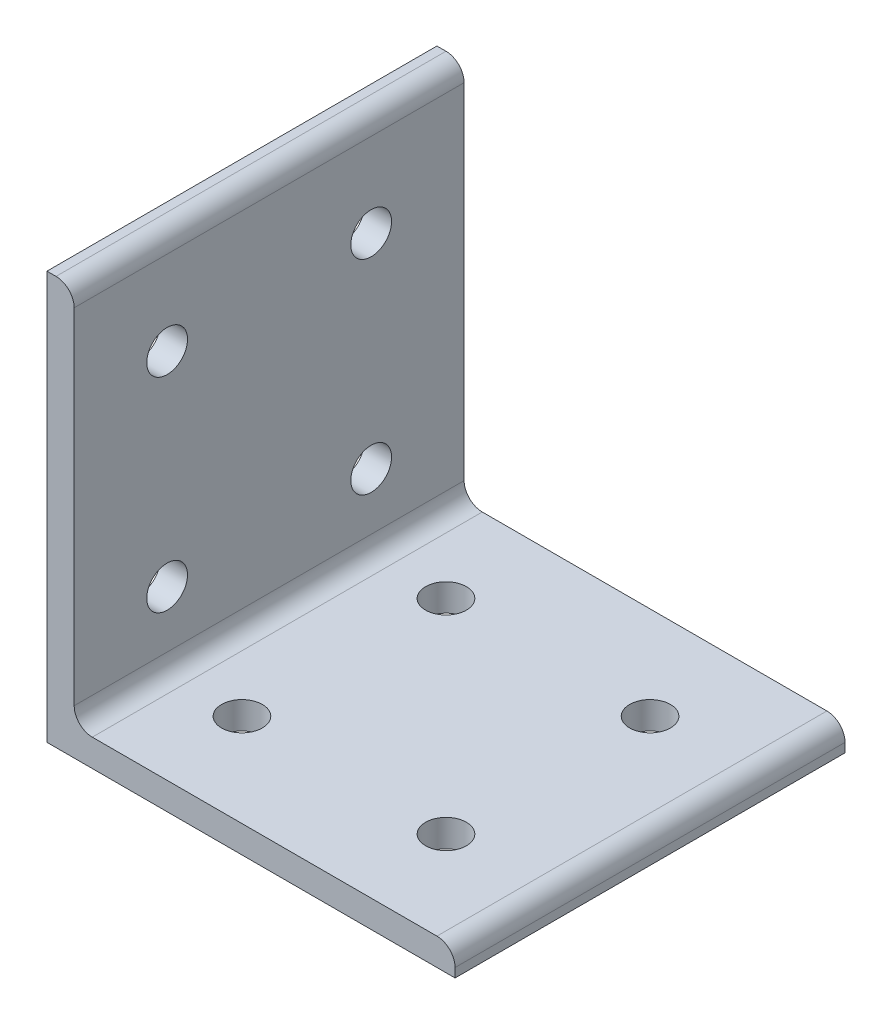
ISO-10303-21;
HEADER;
FILE_DESCRIPTION(('STEP AP214'),'2;1');
FILE_NAME('part.step','',(''),(''),'','','');
FILE_SCHEMA(('AUTOMOTIVE_DESIGN { 1 0 10303 214 1 1 1 1 }'));
ENDSEC;
DATA;
#1=APPLICATION_CONTEXT('core data for automotive mechanical design processes');
#2=APPLICATION_PROTOCOL_DEFINITION('international standard','automotive_design',2000,#1);
#3=PRODUCT_CONTEXT('',#1,'mechanical');
#4=PRODUCT('Part','Part','',(#3));
#5=PRODUCT_RELATED_PRODUCT_CATEGORY('part','',(#4));
#6=PRODUCT_DEFINITION_FORMATION('','',#4);
#7=PRODUCT_DEFINITION_CONTEXT('part definition',#1,'design');
#8=PRODUCT_DEFINITION('design','',#6,#7);
#9=PRODUCT_DEFINITION_SHAPE('','',#8);
#10=(LENGTH_UNIT() NAMED_UNIT(*) SI_UNIT(.MILLI.,.METRE.));
#11=(NAMED_UNIT(*) PLANE_ANGLE_UNIT() SI_UNIT($,.RADIAN.));
#12=(NAMED_UNIT(*) SI_UNIT($,.STERADIAN.) SOLID_ANGLE_UNIT());
#13=UNCERTAINTY_MEASURE_WITH_UNIT(LENGTH_MEASURE(1.E-05),#10,'distance_accuracy_value','');
#14=(GEOMETRIC_REPRESENTATION_CONTEXT(3) GLOBAL_UNCERTAINTY_ASSIGNED_CONTEXT((#13)) GLOBAL_UNIT_ASSIGNED_CONTEXT((#10,
#11,#12)) REPRESENTATION_CONTEXT('',''));
#15=CARTESIAN_POINT('',(0.,0.,0.));
#16=DIRECTION('',(0.,0.,1.));
#17=DIRECTION('',(1.,0.,0.));
#18=AXIS2_PLACEMENT_3D('',#15,#16,#17);
#19=CARTESIAN_POINT('',(5.99999999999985,90.,-43.));
#20=DIRECTION('',(-1.,0.,0.));
#21=DIRECTION('',(0.,0.,1.));
#22=AXIS2_PLACEMENT_3D('',#19,#20,#21);
#23=PLANE('',#22);
#24=CARTESIAN_POINT('',(6.00000000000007,22.5,22.5));
#25=DIRECTION('',(1.,0.,0.));
#26=DIRECTION('',(0.,0.,-1.));
#27=AXIS2_PLACEMENT_3D('',#24,#25,#26);
#28=CIRCLE('',#27,4.5);
#29=CARTESIAN_POINT('',(6.00000000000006,22.5,18.));
#30=VERTEX_POINT('',#29);
#31=EDGE_CURVE('E116',#30,#30,#28,.F.);
#32=ORIENTED_EDGE('',*,*,#31,.T.);
#33=EDGE_LOOP('',(#32));
#34=FACE_BOUND('',#33,.T.);
#35=CARTESIAN_POINT('',(5.99999999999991,22.5,-22.5));
#36=DIRECTION('',(1.,0.,0.));
#37=DIRECTION('',(0.,0.,-1.));
#38=AXIS2_PLACEMENT_3D('',#35,#36,#37);
#39=CIRCLE('',#38,4.5);
#40=CARTESIAN_POINT('',(5.9999999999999,22.5,-27.));
#41=VERTEX_POINT('',#40);
#42=EDGE_CURVE('E120',#41,#41,#39,.F.);
#43=ORIENTED_EDGE('',*,*,#42,.T.);
#44=EDGE_LOOP('',(#43));
#45=FACE_BOUND('',#44,.T.);
#46=CARTESIAN_POINT('',(5.99999999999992,67.5,-22.5));
#47=DIRECTION('',(1.,0.,0.));
#48=DIRECTION('',(0.,0.,-1.));
#49=AXIS2_PLACEMENT_3D('',#46,#47,#48);
#50=CIRCLE('',#49,4.50000000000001);
#51=CARTESIAN_POINT('',(5.9999999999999,67.5,-27.));
#52=VERTEX_POINT('',#51);
#53=EDGE_CURVE('E122',#52,#52,#50,.F.);
#54=ORIENTED_EDGE('',*,*,#53,.T.);
#55=EDGE_LOOP('',(#54));
#56=FACE_BOUND('',#55,.T.);
#57=CARTESIAN_POINT('',(6.00000000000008,67.5,22.5));
#58=DIRECTION('',(1.,0.,0.));
#59=DIRECTION('',(0.,0.,-1.));
#60=AXIS2_PLACEMENT_3D('',#57,#58,#59);
#61=CIRCLE('',#60,4.50000000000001);
#62=CARTESIAN_POINT('',(6.00000000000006,67.5,18.));
#63=VERTEX_POINT('',#62);
#64=EDGE_CURVE('E19',#63,#63,#61,.F.);
#65=ORIENTED_EDGE('',*,*,#64,.T.);
#66=EDGE_LOOP('',(#65));
#67=FACE_BOUND('',#66,.T.);
#68=DIRECTION('',(0.,1.,0.));
#69=VECTOR('',#68,1.);
#70=CARTESIAN_POINT('',(5.99999999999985,0.,-43.));
#71=LINE('',#70,#69);
#72=CARTESIAN_POINT('',(5.99999999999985,86.,-43.));
#73=VERTEX_POINT('',#72);
#74=CARTESIAN_POINT('',(5.99999999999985,10.,-43.));
#75=VERTEX_POINT('',#74);
#76=EDGE_CURVE('E95',#73,#75,#71,.F.);
#77=ORIENTED_EDGE('',*,*,#76,.F.);
#78=DIRECTION('',(0.,0.,1.));
#79=VECTOR('',#78,1.);
#80=CARTESIAN_POINT('',(5.99999999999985,86.,-43.));
#81=LINE('',#80,#79);
#82=CARTESIAN_POINT('',(6.00000000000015,86.,43.));
#83=VERTEX_POINT('',#82);
#84=EDGE_CURVE('E91',#83,#73,#81,.F.);
#85=ORIENTED_EDGE('',*,*,#84,.F.);
#86=DIRECTION('',(0.,1.,0.));
#87=VECTOR('',#86,1.);
#88=CARTESIAN_POINT('',(6.00000000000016,0.,43.));
#89=LINE('',#88,#87);
#90=CARTESIAN_POINT('',(6.00000000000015,10.,43.));
#91=VERTEX_POINT('',#90);
#92=EDGE_CURVE('E94',#83,#91,#89,.F.);
#93=ORIENTED_EDGE('',*,*,#92,.T.);
#94=DIRECTION('',(0.,0.,-1.));
#95=VECTOR('',#94,1.);
#96=CARTESIAN_POINT('',(5.99999999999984,10.,-43.));
#97=LINE('',#96,#95);
#98=EDGE_CURVE('E97',#91,#75,#97,.T.);
#99=ORIENTED_EDGE('',*,*,#98,.T.);
#100=EDGE_LOOP('',(#77,#85,#93,#99));
#101=FACE_BOUND('',#100,.T.);
#102=ADVANCED_FACE('F16',(#34,#45,#56,#67,#101),#23,.F.);
#103=CARTESIAN_POINT('',(9.99999999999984,10.,-43.));
#104=DIRECTION('',(0.,0.,-1.));
#105=DIRECTION('',(-1.,0.,0.));
#106=AXIS2_PLACEMENT_3D('',#103,#104,#105);
#107=CYLINDRICAL_SURFACE('',#106,4.);
#108=CARTESIAN_POINT('',(10.0000000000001,10.,43.));
#109=DIRECTION('',(0.,0.,-1.));
#110=DIRECTION('',(-1.,0.,0.));
#111=AXIS2_PLACEMENT_3D('',#108,#109,#110);
#112=CIRCLE('',#111,4.);
#113=CARTESIAN_POINT('',(10.0000000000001,6.00000000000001,43.));
#114=VERTEX_POINT('',#113);
#115=EDGE_CURVE('E106',#91,#114,#112,.F.);
#116=ORIENTED_EDGE('',*,*,#115,.T.);
#117=DIRECTION('',(0.,0.,1.));
#118=VECTOR('',#117,1.);
#119=CARTESIAN_POINT('',(10.0000000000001,6.00000000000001,-43.));
#120=LINE('',#119,#118);
#121=CARTESIAN_POINT('',(9.99999999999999,6.00000000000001,-43.));
#122=VERTEX_POINT('',#121);
#123=EDGE_CURVE('E111',#114,#122,#120,.F.);
#124=ORIENTED_EDGE('',*,*,#123,.T.);
#125=CARTESIAN_POINT('',(9.99999999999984,10.,-43.));
#126=DIRECTION('',(0.,0.,-1.));
#127=DIRECTION('',(-1.,0.,0.));
#128=AXIS2_PLACEMENT_3D('',#125,#126,#127);
#129=CIRCLE('',#128,4.);
#130=EDGE_CURVE('E198',#75,#122,#129,.F.);
#131=ORIENTED_EDGE('',*,*,#130,.F.);
#132=ORIENTED_EDGE('',*,*,#98,.F.);
#133=EDGE_LOOP('',(#116,#124,#131,#132));
#134=FACE_BOUND('',#133,.T.);
#135=ADVANCED_FACE('F229',(#134),#107,.F.);
#136=CARTESIAN_POINT('',(85.9999999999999,2.,-43.0000000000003));
#137=DIRECTION('',(0.,0.,1.));
#138=DIRECTION('',(1.,0.,0.));
#139=AXIS2_PLACEMENT_3D('',#136,#137,#138);
#140=CYLINDRICAL_SURFACE('',#139,4.);
#141=CARTESIAN_POINT('',(85.9999999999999,2.,-43.0000000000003));
#142=DIRECTION('',(0.,0.,1.));
#143=DIRECTION('',(1.,0.,0.));
#144=AXIS2_PLACEMENT_3D('',#141,#142,#143);
#145=CIRCLE('',#144,4.);
#146=CARTESIAN_POINT('',(85.9999999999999,6.00000000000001,-43.0000000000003));
#147=VERTEX_POINT('',#146);
#148=CARTESIAN_POINT('',(89.9999999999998,2.,-43.0000000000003));
#149=VERTEX_POINT('',#148);
#150=EDGE_CURVE('E194',#147,#149,#145,.F.);
#151=ORIENTED_EDGE('',*,*,#150,.F.);
#152=DIRECTION('',(0.,0.,1.));
#153=VECTOR('',#152,1.);
#154=CARTESIAN_POINT('',(85.9999999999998,6.,-43.));
#155=LINE('',#154,#153);
#156=CARTESIAN_POINT('',(86.,6.00000000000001,42.9999999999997));
#157=VERTEX_POINT('',#156);
#158=EDGE_CURVE('E119',#147,#157,#155,.T.);
#159=ORIENTED_EDGE('',*,*,#158,.T.);
#160=CARTESIAN_POINT('',(86.0000000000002,2.,42.9999999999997));
#161=DIRECTION('',(0.,0.,1.));
#162=DIRECTION('',(1.,0.,0.));
#163=AXIS2_PLACEMENT_3D('',#160,#161,#162);
#164=CIRCLE('',#163,4.);
#165=CARTESIAN_POINT('',(90.0000000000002,2.,42.9999999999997));
#166=VERTEX_POINT('',#165);
#167=EDGE_CURVE('E155',#157,#166,#164,.F.);
#168=ORIENTED_EDGE('',*,*,#167,.T.);
#169=DIRECTION('',(0.,0.,1.));
#170=VECTOR('',#169,1.);
#171=CARTESIAN_POINT('',(89.9999999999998,2.,-43.0000000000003));
#172=LINE('',#171,#170);
#173=EDGE_CURVE('E137',#166,#149,#172,.F.);
#174=ORIENTED_EDGE('',*,*,#173,.T.);
#175=EDGE_LOOP('',(#151,#159,#168,#174));
#176=FACE_BOUND('',#175,.T.);
#177=ADVANCED_FACE('F232',(#176),#140,.T.);
#178=CARTESIAN_POINT('',(1.99999999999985,86.,-43.));
#179=DIRECTION('',(0.,0.,1.));
#180=DIRECTION('',(1.,0.,0.));
#181=AXIS2_PLACEMENT_3D('',#178,#179,#180);
#182=CYLINDRICAL_SURFACE('',#181,4.);
#183=CARTESIAN_POINT('',(1.99999999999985,86.,-43.));
#184=DIRECTION('',(0.,0.,1.));
#185=DIRECTION('',(1.,0.,0.));
#186=AXIS2_PLACEMENT_3D('',#183,#184,#185);
#187=CIRCLE('',#186,4.);
#188=CARTESIAN_POINT('',(1.99999999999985,90.,-43.));
#189=VERTEX_POINT('',#188);
#190=EDGE_CURVE('E160',#189,#73,#187,.F.);
#191=ORIENTED_EDGE('',*,*,#190,.F.);
#192=DIRECTION('',(0.,0.,-1.));
#193=VECTOR('',#192,1.);
#194=CARTESIAN_POINT('',(1.99999999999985,90.,-43.));
#195=LINE('',#194,#193);
#196=CARTESIAN_POINT('',(2.,90.,43.));
#197=VERTEX_POINT('',#196);
#198=EDGE_CURVE('E85',#189,#197,#195,.F.);
#199=ORIENTED_EDGE('',*,*,#198,.T.);
#200=CARTESIAN_POINT('',(2.00000000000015,86.,43.));
#201=DIRECTION('',(0.,0.,1.));
#202=DIRECTION('',(1.,0.,0.));
#203=AXIS2_PLACEMENT_3D('',#200,#201,#202);
#204=CIRCLE('',#203,4.);
#205=EDGE_CURVE('E103',#197,#83,#204,.F.);
#206=ORIENTED_EDGE('',*,*,#205,.T.);
#207=ORIENTED_EDGE('',*,*,#84,.T.);
#208=EDGE_LOOP('',(#191,#199,#206,#207));
#209=FACE_BOUND('',#208,.T.);
#210=ADVANCED_FACE('F108',(#209),#182,.T.);
#211=CARTESIAN_POINT('',(-1.50133697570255E-13,90.,-43.));
#212=DIRECTION('',(0.,-1.,0.));
#213=DIRECTION('',(0.,0.,-1.));
#214=AXIS2_PLACEMENT_3D('',#211,#212,#213);
#215=PLANE('',#214);
#216=DIRECTION('',(-1.,0.,0.));
#217=VECTOR('',#216,1.);
#218=CARTESIAN_POINT('',(89.9999999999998,90.,-43.0000000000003));
#219=LINE('',#218,#217);
#220=CARTESIAN_POINT('',(-1.52655665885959E-13,90.,-43.));
#221=VERTEX_POINT('',#220);
#222=EDGE_CURVE('E193',#221,#189,#219,.F.);
#223=ORIENTED_EDGE('',*,*,#222,.F.);
#224=DIRECTION('',(0.,0.,-1.));
#225=VECTOR('',#224,1.);
#226=CARTESIAN_POINT('',(-1.50133697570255E-13,90.,-43.));
#227=LINE('',#226,#225);
#228=CARTESIAN_POINT('',(1.51394681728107E-13,90.,43.));
#229=VERTEX_POINT('',#228);
#230=EDGE_CURVE('E131',#221,#229,#227,.F.);
#231=ORIENTED_EDGE('',*,*,#230,.T.);
#232=DIRECTION('',(-1.,0.,0.));
#233=VECTOR('',#232,1.);
#234=CARTESIAN_POINT('',(90.0000000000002,90.,42.9999999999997));
#235=LINE('',#234,#233);
#236=EDGE_CURVE('E109',#229,#197,#235,.F.);
#237=ORIENTED_EDGE('',*,*,#236,.T.);
#238=ORIENTED_EDGE('',*,*,#198,.F.);
#239=EDGE_LOOP('',(#223,#231,#237,#238));
#240=FACE_BOUND('',#239,.T.);
#241=ADVANCED_FACE('F226',(#240),#215,.F.);
#242=CARTESIAN_POINT('',(0.,67.5,22.5));
#243=DIRECTION('',(1.,0.,0.));
#244=DIRECTION('',(0.,0.,-1.));
#245=AXIS2_PLACEMENT_3D('',#242,#243,#244);
#246=CYLINDRICAL_SURFACE('',#245,4.50000000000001);
#247=ORIENTED_EDGE('',*,*,#64,.F.);
#248=EDGE_LOOP('',(#247));
#249=FACE_BOUND('',#248,.T.);
#250=CARTESIAN_POINT('',(0.,67.5,22.5));
#251=DIRECTION('',(1.,0.,0.));
#252=DIRECTION('',(0.,0.,-1.));
#253=AXIS2_PLACEMENT_3D('',#250,#251,#252);
#254=CIRCLE('',#253,4.50000000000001);
#255=CARTESIAN_POINT('',(0.,67.5,18.));
#256=VERTEX_POINT('',#255);
#257=EDGE_CURVE('E134',#256,#256,#254,.F.);
#258=ORIENTED_EDGE('',*,*,#257,.T.);
#259=EDGE_LOOP('',(#258));
#260=FACE_BOUND('',#259,.T.);
#261=ADVANCED_FACE('F288',(#249,#260),#246,.F.);
#262=CARTESIAN_POINT('',(0.,67.5,-22.5));
#263=DIRECTION('',(1.,0.,0.));
#264=DIRECTION('',(0.,0.,-1.));
#265=AXIS2_PLACEMENT_3D('',#262,#263,#264);
#266=CYLINDRICAL_SURFACE('',#265,4.50000000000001);
#267=ORIENTED_EDGE('',*,*,#53,.F.);
#268=EDGE_LOOP('',(#267));
#269=FACE_BOUND('',#268,.T.);
#270=CARTESIAN_POINT('',(0.,67.5,-22.5));
#271=DIRECTION('',(1.,0.,0.));
#272=DIRECTION('',(0.,0.,-1.));
#273=AXIS2_PLACEMENT_3D('',#270,#271,#272);
#274=CIRCLE('',#273,4.50000000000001);
#275=CARTESIAN_POINT('',(0.,67.5,-27.));
#276=VERTEX_POINT('',#275);
#277=EDGE_CURVE('E187',#276,#276,#274,.F.);
#278=ORIENTED_EDGE('',*,*,#277,.T.);
#279=EDGE_LOOP('',(#278));
#280=FACE_BOUND('',#279,.T.);
#281=ADVANCED_FACE('F284',(#269,#280),#266,.F.);
#282=CARTESIAN_POINT('',(0.,22.5,-22.5));
#283=DIRECTION('',(1.,0.,0.));
#284=DIRECTION('',(0.,0.,-1.));
#285=AXIS2_PLACEMENT_3D('',#282,#283,#284);
#286=CYLINDRICAL_SURFACE('',#285,4.5);
#287=ORIENTED_EDGE('',*,*,#42,.F.);
#288=EDGE_LOOP('',(#287));
#289=FACE_BOUND('',#288,.T.);
#290=CARTESIAN_POINT('',(0.,22.5,-22.5));
#291=DIRECTION('',(1.,0.,0.));
#292=DIRECTION('',(0.,0.,-1.));
#293=AXIS2_PLACEMENT_3D('',#290,#291,#292);
#294=CIRCLE('',#293,4.5);
#295=CARTESIAN_POINT('',(0.,22.5,-27.));
#296=VERTEX_POINT('',#295);
#297=EDGE_CURVE('E184',#296,#296,#294,.F.);
#298=ORIENTED_EDGE('',*,*,#297,.T.);
#299=EDGE_LOOP('',(#298));
#300=FACE_BOUND('',#299,.T.);
#301=ADVANCED_FACE('F280',(#289,#300),#286,.F.);
#302=CARTESIAN_POINT('',(0.,22.5,22.5));
#303=DIRECTION('',(1.,0.,0.));
#304=DIRECTION('',(0.,0.,-1.));
#305=AXIS2_PLACEMENT_3D('',#302,#303,#304);
#306=CYLINDRICAL_SURFACE('',#305,4.5);
#307=ORIENTED_EDGE('',*,*,#31,.F.);
#308=EDGE_LOOP('',(#307));
#309=FACE_BOUND('',#308,.T.);
#310=CARTESIAN_POINT('',(0.,22.5,22.5));
#311=DIRECTION('',(1.,0.,0.));
#312=DIRECTION('',(0.,0.,-1.));
#313=AXIS2_PLACEMENT_3D('',#310,#311,#312);
#314=CIRCLE('',#313,4.5);
#315=CARTESIAN_POINT('',(0.,22.5,18.));
#316=VERTEX_POINT('',#315);
#317=EDGE_CURVE('E181',#316,#316,#314,.F.);
#318=ORIENTED_EDGE('',*,*,#317,.T.);
#319=EDGE_LOOP('',(#318));
#320=FACE_BOUND('',#319,.T.);
#321=ADVANCED_FACE('F276',(#309,#320),#306,.F.);
#322=CARTESIAN_POINT('',(5.99999999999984,6.00000000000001,-43.));
#323=DIRECTION('',(0.,-1.,0.));
#324=DIRECTION('',(1.,0.,0.));
#325=AXIS2_PLACEMENT_3D('',#322,#323,#324);
#326=PLANE('',#325);
#327=CARTESIAN_POINT('',(67.4999999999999,6.,-22.5000000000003));
#328=DIRECTION('',(0.,1.,0.));
#329=DIRECTION('',(-1.,0.,0.));
#330=AXIS2_PLACEMENT_3D('',#327,#328,#329);
#331=CIRCLE('',#330,4.5);
#332=CARTESIAN_POINT('',(62.9999999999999,6.00000000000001,-22.5000000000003));
#333=VERTEX_POINT('',#332);
#334=EDGE_CURVE('E158',#333,#333,#331,.F.);
#335=ORIENTED_EDGE('',*,*,#334,.T.);
#336=EDGE_LOOP('',(#335));
#337=FACE_BOUND('',#336,.T.);
#338=CARTESIAN_POINT('',(22.4999999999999,6.00000000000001,-22.5000000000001));
#339=DIRECTION('',(0.,1.,0.));
#340=DIRECTION('',(-1.,0.,0.));
#341=AXIS2_PLACEMENT_3D('',#338,#339,#340);
#342=CIRCLE('',#341,4.5);
#343=CARTESIAN_POINT('',(17.9999999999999,6.00000000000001,-22.5000000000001));
#344=VERTEX_POINT('',#343);
#345=EDGE_CURVE('E172',#344,#344,#342,.F.);
#346=ORIENTED_EDGE('',*,*,#345,.T.);
#347=EDGE_LOOP('',(#346));
#348=FACE_BOUND('',#347,.T.);
#349=CARTESIAN_POINT('',(67.5000000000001,6.,22.4999999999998));
#350=DIRECTION('',(0.,1.,0.));
#351=DIRECTION('',(-1.,0.,0.));
#352=AXIS2_PLACEMENT_3D('',#349,#350,#351);
#353=CIRCLE('',#352,4.5);
#354=CARTESIAN_POINT('',(63.0000000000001,6.00000000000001,22.4999999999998));
#355=VERTEX_POINT('',#354);
#356=EDGE_CURVE('E175',#355,#355,#353,.F.);
#357=ORIENTED_EDGE('',*,*,#356,.T.);
#358=EDGE_LOOP('',(#357));
#359=FACE_BOUND('',#358,.T.);
#360=CARTESIAN_POINT('',(22.5000000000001,6.00000000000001,22.4999999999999));
#361=DIRECTION('',(0.,1.,0.));
#362=DIRECTION('',(-1.,0.,0.));
#363=AXIS2_PLACEMENT_3D('',#360,#361,#362);
#364=CIRCLE('',#363,4.5);
#365=CARTESIAN_POINT('',(18.0000000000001,6.00000000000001,22.4999999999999));
#366=VERTEX_POINT('',#365);
#367=EDGE_CURVE('E178',#366,#366,#364,.F.);
#368=ORIENTED_EDGE('',*,*,#367,.T.);
#369=EDGE_LOOP('',(#368));
#370=FACE_BOUND('',#369,.T.);
#371=DIRECTION('',(-1.,0.,0.));
#372=VECTOR('',#371,1.);
#373=CARTESIAN_POINT('',(90.0000000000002,6.00000000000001,42.9999999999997));
#374=LINE('',#373,#372);
#375=EDGE_CURVE('E199',#114,#157,#374,.F.);
#376=ORIENTED_EDGE('',*,*,#375,.T.);
#377=ORIENTED_EDGE('',*,*,#158,.F.);
#378=DIRECTION('',(-1.,0.,0.));
#379=VECTOR('',#378,1.);
#380=CARTESIAN_POINT('',(89.9999999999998,6.00000000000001,-43.0000000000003));
#381=LINE('',#380,#379);
#382=EDGE_CURVE('E197',#122,#147,#381,.F.);
#383=ORIENTED_EDGE('',*,*,#382,.F.);
#384=ORIENTED_EDGE('',*,*,#123,.F.);
#385=EDGE_LOOP('',(#376,#377,#383,#384));
#386=FACE_BOUND('',#385,.T.);
#387=ADVANCED_FACE('F231',(#337,#348,#359,#370,#386),#326,.F.);
#388=CARTESIAN_POINT('',(90.0000000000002,0.,42.9999999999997));
#389=DIRECTION('',(0.,0.,-1.));
#390=DIRECTION('',(-1.,0.,0.));
#391=AXIS2_PLACEMENT_3D('',#388,#389,#390);
#392=PLANE('',#391);
#393=ORIENTED_EDGE('',*,*,#375,.F.);
#394=ORIENTED_EDGE('',*,*,#115,.F.);
#395=ORIENTED_EDGE('',*,*,#92,.F.);
#396=ORIENTED_EDGE('',*,*,#205,.F.);
#397=ORIENTED_EDGE('',*,*,#236,.F.);
#398=DIRECTION('',(0.,1.,0.));
#399=VECTOR('',#398,1.);
#400=CARTESIAN_POINT('',(1.50133697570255E-13,0.,43.));
#401=LINE('',#400,#399);
#402=CARTESIAN_POINT('',(0.,0.,43.));
#403=VERTEX_POINT('',#402);
#404=EDGE_CURVE('E136',#229,#403,#401,.F.);
#405=ORIENTED_EDGE('',*,*,#404,.T.);
#406=DIRECTION('',(1.,0.,0.));
#407=VECTOR('',#406,1.);
#408=CARTESIAN_POINT('',(89.9999999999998,0.,43.));
#409=LINE('',#408,#407);
#410=CARTESIAN_POINT('',(90.0000000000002,0.,42.9999999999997));
#411=VERTEX_POINT('',#410);
#412=EDGE_CURVE('E148',#403,#411,#409,.T.);
#413=ORIENTED_EDGE('',*,*,#412,.T.);
#414=DIRECTION('',(0.,1.,0.));
#415=VECTOR('',#414,1.);
#416=CARTESIAN_POINT('',(90.0000000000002,6.,42.9999999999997));
#417=LINE('',#416,#415);
#418=EDGE_CURVE('E140',#411,#166,#417,.T.);
#419=ORIENTED_EDGE('',*,*,#418,.T.);
#420=ORIENTED_EDGE('',*,*,#167,.F.);
#421=EDGE_LOOP('',(#393,#394,#395,#396,#397,#405,#413,#419,#420));
#422=FACE_BOUND('',#421,.T.);
#423=ADVANCED_FACE('F102',(#422),#392,.F.);
#424=CARTESIAN_POINT('',(89.9999999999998,6.,-43.0000000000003));
#425=DIRECTION('',(-1.,0.,0.));
#426=DIRECTION('',(0.,0.,1.));
#427=AXIS2_PLACEMENT_3D('',#424,#425,#426);
#428=PLANE('',#427);
#429=ORIENTED_EDGE('',*,*,#418,.F.);
#430=DIRECTION('',(0.,0.,1.));
#431=VECTOR('',#430,1.);
#432=CARTESIAN_POINT('',(90.0000000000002,0.,-43.0000000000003));
#433=LINE('',#432,#431);
#434=CARTESIAN_POINT('',(89.9999999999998,0.,-43.0000000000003));
#435=VERTEX_POINT('',#434);
#436=EDGE_CURVE('E145',#411,#435,#433,.F.);
#437=ORIENTED_EDGE('',*,*,#436,.T.);
#438=DIRECTION('',(0.,1.,0.));
#439=VECTOR('',#438,1.);
#440=CARTESIAN_POINT('',(89.9999999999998,0.,-43.0000000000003));
#441=LINE('',#440,#439);
#442=EDGE_CURVE('E196',#149,#435,#441,.F.);
#443=ORIENTED_EDGE('',*,*,#442,.F.);
#444=ORIENTED_EDGE('',*,*,#173,.F.);
#445=EDGE_LOOP('',(#429,#437,#443,#444));
#446=FACE_BOUND('',#445,.T.);
#447=ADVANCED_FACE('F224',(#446),#428,.F.);
#448=CARTESIAN_POINT('',(89.9999999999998,0.,-43.0000000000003));
#449=DIRECTION('',(0.,0.,-1.));
#450=DIRECTION('',(-1.,0.,0.));
#451=AXIS2_PLACEMENT_3D('',#448,#449,#450);
#452=PLANE('',#451);
#453=ORIENTED_EDGE('',*,*,#222,.T.);
#454=ORIENTED_EDGE('',*,*,#190,.T.);
#455=ORIENTED_EDGE('',*,*,#76,.T.);
#456=ORIENTED_EDGE('',*,*,#130,.T.);
#457=ORIENTED_EDGE('',*,*,#382,.T.);
#458=ORIENTED_EDGE('',*,*,#150,.T.);
#459=ORIENTED_EDGE('',*,*,#442,.T.);
#460=DIRECTION('',(1.,0.,0.));
#461=VECTOR('',#460,1.);
#462=CARTESIAN_POINT('',(89.9999999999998,0.,-43.0000000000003));
#463=LINE('',#462,#461);
#464=CARTESIAN_POINT('',(-1.52025173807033E-13,0.,-43.0000000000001));
#465=VERTEX_POINT('',#464);
#466=EDGE_CURVE('E141',#435,#465,#463,.F.);
#467=ORIENTED_EDGE('',*,*,#466,.T.);
#468=DIRECTION('',(0.,1.,0.));
#469=VECTOR('',#468,1.);
#470=CARTESIAN_POINT('',(-1.50133697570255E-13,0.,-43.));
#471=LINE('',#470,#469);
#472=EDGE_CURVE('E34',#465,#221,#471,.T.);
#473=ORIENTED_EDGE('',*,*,#472,.T.);
#474=EDGE_LOOP('',(#453,#454,#455,#456,#457,#458,#459,#467,#473));
#475=FACE_BOUND('',#474,.T.);
#476=ADVANCED_FACE('F220',(#475),#452,.T.);
#477=CARTESIAN_POINT('',(-1.50133697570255E-13,0.,-43.));
#478=DIRECTION('',(1.,0.,0.));
#479=DIRECTION('',(0.,0.,-1.));
#480=AXIS2_PLACEMENT_3D('',#477,#478,#479);
#481=PLANE('',#480);
#482=ORIENTED_EDGE('',*,*,#317,.F.);
#483=EDGE_LOOP('',(#482));
#484=FACE_BOUND('',#483,.T.);
#485=ORIENTED_EDGE('',*,*,#297,.F.);
#486=EDGE_LOOP('',(#485));
#487=FACE_BOUND('',#486,.T.);
#488=ORIENTED_EDGE('',*,*,#277,.F.);
#489=EDGE_LOOP('',(#488));
#490=FACE_BOUND('',#489,.T.);
#491=ORIENTED_EDGE('',*,*,#257,.F.);
#492=EDGE_LOOP('',(#491));
#493=FACE_BOUND('',#492,.T.);
#494=ORIENTED_EDGE('',*,*,#472,.F.);
#495=DIRECTION('',(0.,0.,1.));
#496=VECTOR('',#495,1.);
#497=CARTESIAN_POINT('',(-1.52655665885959E-13,0.,-43.0000000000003));
#498=LINE('',#497,#496);
#499=EDGE_CURVE('E144',#465,#403,#498,.T.);
#500=ORIENTED_EDGE('',*,*,#499,.T.);
#501=ORIENTED_EDGE('',*,*,#404,.F.);
#502=ORIENTED_EDGE('',*,*,#230,.F.);
#503=EDGE_LOOP('',(#494,#500,#501,#502));
#504=FACE_BOUND('',#503,.T.);
#505=ADVANCED_FACE('F214',(#484,#487,#490,#493,#504),#481,.F.);
#506=CARTESIAN_POINT('',(22.5000000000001,0.,22.4999999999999));
#507=DIRECTION('',(0.,1.,0.));
#508=DIRECTION('',(-1.,0.,0.));
#509=AXIS2_PLACEMENT_3D('',#506,#507,#508);
#510=CYLINDRICAL_SURFACE('',#509,4.5);
#511=ORIENTED_EDGE('',*,*,#367,.F.);
#512=EDGE_LOOP('',(#511));
#513=FACE_BOUND('',#512,.T.);
#514=CARTESIAN_POINT('',(22.5000000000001,0.,22.4999999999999));
#515=DIRECTION('',(0.,1.,0.));
#516=DIRECTION('',(-1.,0.,0.));
#517=AXIS2_PLACEMENT_3D('',#514,#515,#516);
#518=CIRCLE('',#517,4.5);
#519=CARTESIAN_POINT('',(18.0000000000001,0.,22.4999999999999));
#520=VERTEX_POINT('',#519);
#521=EDGE_CURVE('E167',#520,#520,#518,.F.);
#522=ORIENTED_EDGE('',*,*,#521,.T.);
#523=EDGE_LOOP('',(#522));
#524=FACE_BOUND('',#523,.T.);
#525=ADVANCED_FACE('F260',(#513,#524),#510,.F.);
#526=CARTESIAN_POINT('',(67.5000000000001,0.,22.4999999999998));
#527=DIRECTION('',(0.,1.,0.));
#528=DIRECTION('',(-1.,0.,0.));
#529=AXIS2_PLACEMENT_3D('',#526,#527,#528);
#530=CYLINDRICAL_SURFACE('',#529,4.5);
#531=ORIENTED_EDGE('',*,*,#356,.F.);
#532=EDGE_LOOP('',(#531));
#533=FACE_BOUND('',#532,.T.);
#534=CARTESIAN_POINT('',(67.5000000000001,0.,22.4999999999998));
#535=DIRECTION('',(0.,1.,0.));
#536=DIRECTION('',(-1.,0.,0.));
#537=AXIS2_PLACEMENT_3D('',#534,#535,#536);
#538=CIRCLE('',#537,4.5);
#539=CARTESIAN_POINT('',(63.0000000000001,0.,22.4999999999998));
#540=VERTEX_POINT('',#539);
#541=EDGE_CURVE('E164',#540,#540,#538,.F.);
#542=ORIENTED_EDGE('',*,*,#541,.T.);
#543=EDGE_LOOP('',(#542));
#544=FACE_BOUND('',#543,.T.);
#545=ADVANCED_FACE('F256',(#533,#544),#530,.F.);
#546=CARTESIAN_POINT('',(22.4999999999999,0.,-22.5000000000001));
#547=DIRECTION('',(0.,1.,0.));
#548=DIRECTION('',(-1.,0.,0.));
#549=AXIS2_PLACEMENT_3D('',#546,#547,#548);
#550=CYLINDRICAL_SURFACE('',#549,4.5);
#551=ORIENTED_EDGE('',*,*,#345,.F.);
#552=EDGE_LOOP('',(#551));
#553=FACE_BOUND('',#552,.T.);
#554=CARTESIAN_POINT('',(22.4999999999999,0.,-22.5000000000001));
#555=DIRECTION('',(0.,1.,0.));
#556=DIRECTION('',(-1.,0.,0.));
#557=AXIS2_PLACEMENT_3D('',#554,#555,#556);
#558=CIRCLE('',#557,4.5);
#559=CARTESIAN_POINT('',(17.9999999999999,0.,-22.5000000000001));
#560=VERTEX_POINT('',#559);
#561=EDGE_CURVE('E25',#560,#560,#558,.F.);
#562=ORIENTED_EDGE('',*,*,#561,.T.);
#563=EDGE_LOOP('',(#562));
#564=FACE_BOUND('',#563,.T.);
#565=ADVANCED_FACE('F248',(#553,#564),#550,.F.);
#566=CARTESIAN_POINT('',(67.4999999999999,0.,-22.5000000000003));
#567=DIRECTION('',(0.,1.,0.));
#568=DIRECTION('',(-1.,0.,0.));
#569=AXIS2_PLACEMENT_3D('',#566,#567,#568);
#570=CYLINDRICAL_SURFACE('',#569,4.5);
#571=ORIENTED_EDGE('',*,*,#334,.F.);
#572=EDGE_LOOP('',(#571));
#573=FACE_BOUND('',#572,.T.);
#574=CARTESIAN_POINT('',(67.4999999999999,0.,-22.5000000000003));
#575=DIRECTION('',(0.,1.,0.));
#576=DIRECTION('',(-1.,0.,0.));
#577=AXIS2_PLACEMENT_3D('',#574,#575,#576);
#578=CIRCLE('',#577,4.5);
#579=CARTESIAN_POINT('',(62.9999999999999,0.,-22.5000000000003));
#580=VERTEX_POINT('',#579);
#581=EDGE_CURVE('E11',#580,#580,#578,.F.);
#582=ORIENTED_EDGE('',*,*,#581,.T.);
#583=EDGE_LOOP('',(#582));
#584=FACE_BOUND('',#583,.T.);
#585=ADVANCED_FACE('F242',(#573,#584),#570,.F.);
#586=CARTESIAN_POINT('',(89.9999999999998,0.,-43.0000000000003));
#587=DIRECTION('',(0.,1.,0.));
#588=DIRECTION('',(0.,0.,1.));
#589=AXIS2_PLACEMENT_3D('',#586,#587,#588);
#590=PLANE('',#589);
#591=ORIENTED_EDGE('',*,*,#581,.F.);
#592=EDGE_LOOP('',(#591));
#593=FACE_BOUND('',#592,.T.);
#594=ORIENTED_EDGE('',*,*,#561,.F.);
#595=EDGE_LOOP('',(#594));
#596=FACE_BOUND('',#595,.T.);
#597=ORIENTED_EDGE('',*,*,#541,.F.);
#598=EDGE_LOOP('',(#597));
#599=FACE_BOUND('',#598,.T.);
#600=ORIENTED_EDGE('',*,*,#521,.F.);
#601=EDGE_LOOP('',(#600));
#602=FACE_BOUND('',#601,.T.);
#603=ORIENTED_EDGE('',*,*,#466,.F.);
#604=ORIENTED_EDGE('',*,*,#436,.F.);
#605=ORIENTED_EDGE('',*,*,#412,.F.);
#606=ORIENTED_EDGE('',*,*,#499,.F.);
#607=EDGE_LOOP('',(#603,#604,#605,#606));
#608=FACE_BOUND('',#607,.T.);
#609=ADVANCED_FACE('F217',(#593,#596,#599,#602,#608),#590,.F.);
#610=CLOSED_SHELL('',(#102,#135,#177,#210,#241,#261,#281,#301,#321,#387,#423,#447,#476,#505,
#525,#545,#565,#585,#609));
#611=MANIFOLD_SOLID_BREP('B1',#610);
#612=ADVANCED_BREP_SHAPE_REPRESENTATION('',(#18,#611),#14);
#613=SHAPE_DEFINITION_REPRESENTATION(#9,#612);
ENDSEC;
END-ISO-10303-21;
